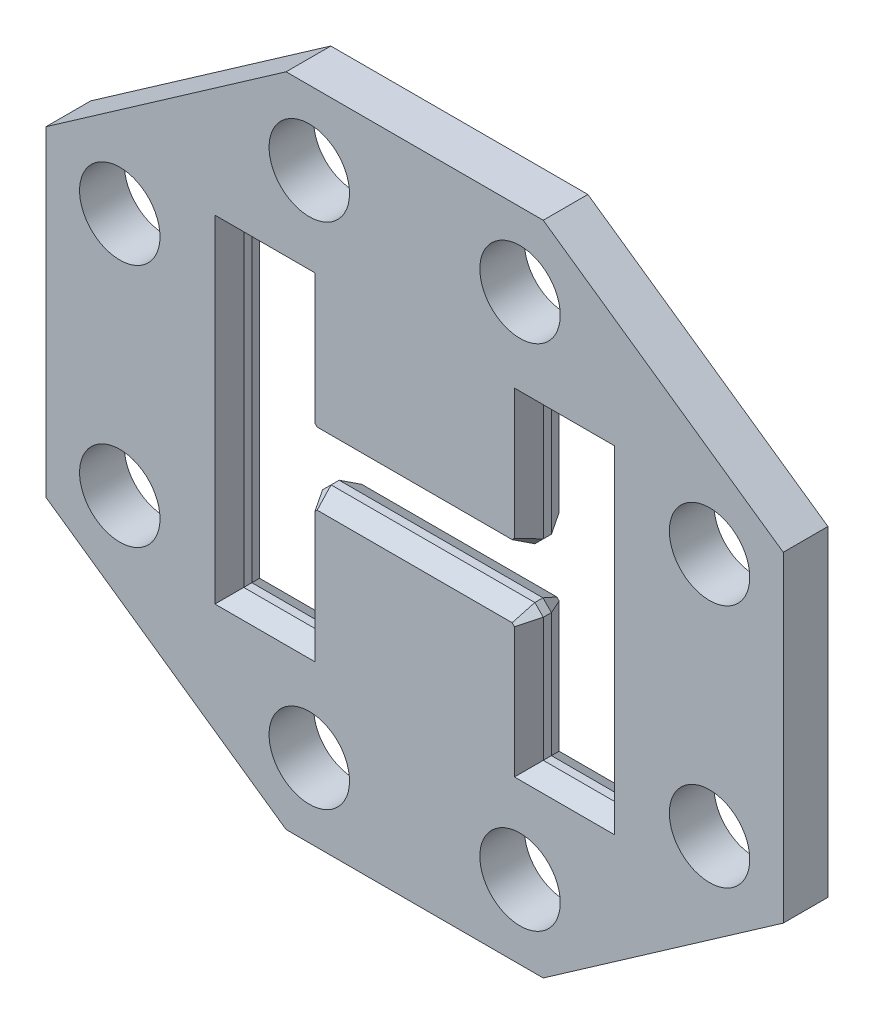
from build123d import *

# Parameters (mm, degrees)
MAIN_PLATE_DEPTH        = 31.75
SKETCH7_W               = 488.427889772
SKETCH7_H               = 597.424429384
EXTRUDE_W605_DEPTH      = 31.75
CUT_EXTRUDE1_DEPTH      = 703.061769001
CUT_EXTRUDE1_DEPTH_BACK = 703.061769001
SKETCH5_R               = 57.15
CHAMFER1_SIZE           = 15
CHAMFER1_SIZE2          = 25.980762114
CHAMFER2_SIZE           = 15
CHAMFER2_SIZE2          = 25.980762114


with BuildPart() as part:
    # Sketch3 → Main Plate (new, symmetric)
    with BuildSketch(Plane(origin=(0, 0, 0), x_dir=(0, 1, 0), z_dir=(0, 0, 1))):
        Polygon((228.234235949, 523.855268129), (466.324268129, 182.70492307), (466.324268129, -182.70492307), (228.234235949, -523.855268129), (-228.234235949, -523.855268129), (-466.324268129, -182.70492307), (-466.324268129, 182.70492307), (-228.234235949, 523.855268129), align=None)
        Polygon((-54.229, 156.845), (-230.378, 156.845), (-230.378, 287.909), (230.378, 287.909), (230.378, 156.845), (54.229, 156.845), (42.164, 144.78), (42.164, -144.78), (54.229, -156.845), (230.378, -156.845), (230.378, -287.909), (-230.378, -287.909), (-230.378, -156.845), (-54.229, -156.845), (-42.164, -144.78), (-42.164, 144.78), align=None, mode=Mode.SUBTRACT)
    extrude(amount=MAIN_PLATE_DEPTH, both=True)

    # Sketch7 → Extrude W605 (add, symmetric)
    with BuildSketch(Plane(origin=(0, 0, 0), x_dir=(0, 1, 0), z_dir=(0, 0, 1))):
        with Locations((1.882804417, 0.023527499)):
            Rectangle(SKETCH7_W, SKETCH7_H)
        Polygon((-224.3455, -268.859), (-224.3455, -156.845), (-48.1965, -156.845), (-36.1315, -144.78), (-36.1315, 144.78), (-48.1965, 156.845), (-224.3455, 156.845), (-224.3455, 268.859), (224.3455, 268.859), (224.3455, 156.845), (48.1965, 156.845), (36.1315, 144.78), (36.1315, -144.78), (48.1965, -156.845), (224.3455, -156.845), (224.3455, -268.859), align=None, mode=Mode.SUBTRACT)
    extrude(amount=EXTRUDE_W605_DEPTH, both=True)

    # Sketch5 → Cut-Extrude1 (cut, two sides: drawn at the far end of the back side and taken through both)
    with BuildSketch(Plane(origin=(0, 0, 0), x_dir=(0, 1, 0), z_dir=(0, 0, 1)).offset(-CUT_EXTRUDE1_DEPTH_BACK)):
        with Locations(Location((-173.588730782, 419.080268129, 0), (0, 0, 270))):
            Circle(SKETCH5_R)
        with Locations(Location((173.588730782, 419.080268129, 0), (0, 0, 270))):
            Circle(SKETCH5_R)
        with Locations(Location((361.549268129, 149.758610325, 0), (0, 0, 270))):
            Circle(SKETCH5_R)
        with Locations(Location((361.549268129, -149.758610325, 0), (0, 0, 270))):
            Circle(SKETCH5_R)
        with Locations(Location((173.588730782, -419.080268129, 0), (0, 0, 270))):
            Circle(SKETCH5_R)
        with Locations(Location((-173.588730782, -419.080268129, 0), (0, 0, 270))):
            Circle(SKETCH5_R)
        with Locations(Location((-361.549268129, -149.758610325, 0), (0, 0, 270))):
            Circle(SKETCH5_R)
        with Locations(Location((-361.549268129, 149.758610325, 0), (0, 0, 270))):
            Circle(SKETCH5_R)
    extrude(amount=CUT_EXTRUDE1_DEPTH + CUT_EXTRUDE1_DEPTH_BACK, mode=Mode.SUBTRACT)

    # Chamfer1
    chamfer1_edges = [part.edges().sort_by_distance(p)[0] for p in [
        (212.852, -224.3455, 31.75),
        (268.859, 0, 31.75),
        (212.852, 224.3455, 31.75),
        (150.8125, 42.164, 31.75),
        (0, 36.1315, 31.75),
        (-150.8125, 42.164, 31.75),
        (-212.852, 224.3455, 31.75),
        (-268.859, 0, 31.75),
        (-212.852, -224.3455, 31.75),
        (-150.8125, -42.164, 31.75),
        (0, -36.1315, 31.75),
        (156.845, -136.271, 31.75),
        (-156.845, 136.271, 31.75),
        (-156.845, -136.271, 31.75),
        (156.845, 136.271, 31.75),
        (150.8125, -42.164, 31.75),
    ]]
    chamfer1_side = [part.faces().sort_by_distance(p)[0] for p in [
        (-345.252406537, 335.776675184, 31.75),
    ]]
    chamfer(chamfer1_edges, length=CHAMFER1_SIZE, length2=CHAMFER1_SIZE2, reference=chamfer1_side[0])

    # Chamfer2
    chamfer2_edges = [part.edges().sort_by_distance(p)[0] for p in [
        (156.845, -136.271, -31.75),
        (-156.845, 136.271, -31.75),
        (-156.845, -136.271, -31.75),
        (156.845, 136.271, -31.75),
        (150.8125, 42.164, -31.75),
        (0, 36.1315, -31.75),
        (-150.8125, 42.164, -31.75),
        (212.852, -224.3455, -31.75),
        (268.859, 0, -31.75),
        (212.852, 224.3455, -31.75),
        (-212.852, 224.3455, -31.75),
        (-268.859, 0, -31.75),
        (-212.852, -224.3455, -31.75),
        (-150.8125, -42.164, -31.75),
        (0, -36.1315, -31.75),
        (150.8125, -42.164, -31.75),
    ]]
    chamfer2_side = [part.faces().sort_by_distance(p)[0] for p in [
        (-345.252406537, 335.776675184, -31.75),
    ]]
    chamfer(chamfer2_edges, length=CHAMFER2_SIZE, length2=CHAMFER2_SIZE2, reference=chamfer2_side[0])


solid = part.part
